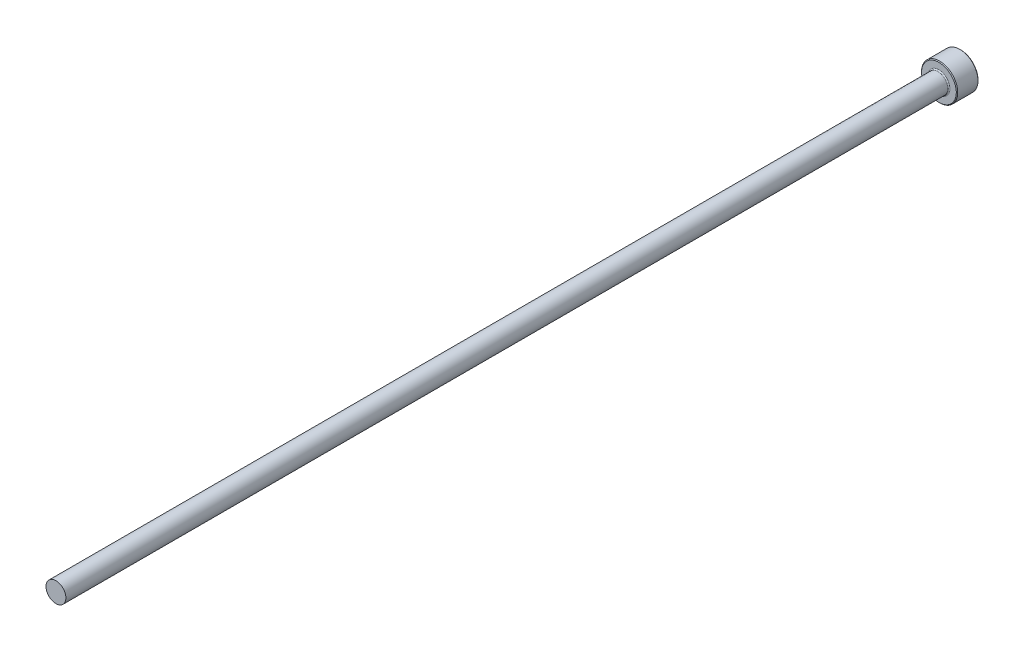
from build123d import *

# Parameters (mm, degrees)
CHAMFER1_SIZE = 0.2


with BuildPart() as part:
    # Sketch1 → Revolve1 (revolve)
    with BuildSketch(Plane(origin=(0, 0, 0), x_dir=(0, 0, -1), z_dir=(1, 0, 0)), mode=Mode.PRIVATE) as revolve1_sk:
        with BuildLine():
            Line((0, 0), (0, 5))
            Line((0, 5), (-6, 5))
            Line((-6, 5), (-6, 3.05))
            ThreePointArc((-6, 3.05), (-6.087867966, 2.837867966), (-6.3, 2.75))
            Line((-6.3, 2.75), (-250, 2.75))
            Line((-250, 2.75), (-250, 0))
            Line((-250, 0), (0, 0))
        make_face()
    revolve(revolve1_sk.sketch.rotate(Axis((0, 0, 109.05062828), (0, 0, -1)), 90), axis=Axis((0, 0, 109.05062828), (0, 0, -1)))

    # Chamfer1
    chamfer1_edges = [part.edges().sort_by_distance(p)[0] for p in [
        (-5, 0, 0),
        (-5, 0, 6),
    ]]
    chamfer(chamfer1_edges, length=CHAMFER1_SIZE)


solid = part.part
